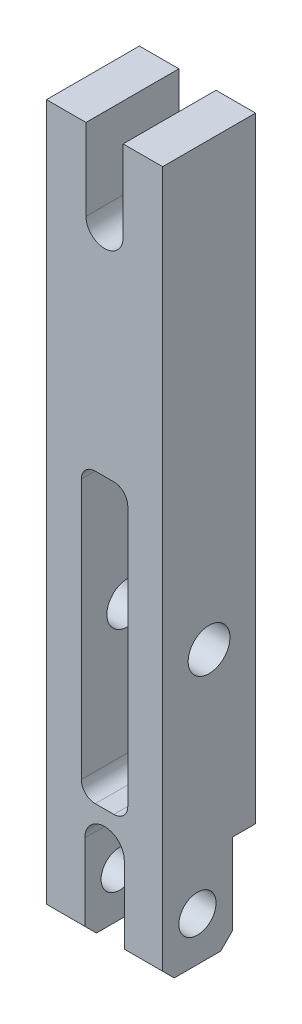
from build123d import *

# Parameters (mm, degrees)
VOLUME_DEPTH               = 40
ESQUISSE6_W                = 30
ESQUISSE6_H                = 60
EVIDEMMENT_DEPTH           = 201.499376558
ESQUISSE2_R                = 8
AL_SAGE_16_DEPTH           = 201.499376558
ESQUISSE5_R                = 9
AL_SAGE_18_PALONNIER_DEPTH = 201.499376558
CHANFREIN1_SIZE            = 5


with BuildPart() as part:
    # Esquisse1 → Volume (new body)
    with BuildSketch(Plane.XY):
        with BuildLine():
            Line((8, 190), (25, 190))
            Line((25, 190), (25, -115))
            Line((25, -115), (8.5, -115))
            Line((8.5, -115), (8.5, -77))
            ThreePointArc((8.5, -77), (0, -68.5), (-8.5, -77))
            Line((-8.5, -77), (-8.5, -115))
            Line((-8.5, -115), (-25, -115))
            Line((-25, -115), (-25, 190))
            Line((-25, 190), (-8, 190))
            Line((-8, 190), (-8, 155))
            ThreePointArc((-8, 155), (0, 147), (8, 155))
            Line((8, 155), (8, 190))
        make_face()
        with BuildLine():
            Line((-4, 62), (4, 62))
            ThreePointArc((4, 62), (8.242640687, 60.242640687), (10, 56))
            Line((10, 56), (10, -56))
            ThreePointArc((10, -56), (8.242640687, -60.242640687), (4, -62))
            Line((4, -62), (-4, -62))
            ThreePointArc((-4, -62), (-8.242640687, -60.242640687), (-10, -56))
            Line((-10, -56), (-10, 56))
            ThreePointArc((-10, 56), (-8.242640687, 60.242640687), (-4, 62))
        make_face(mode=Mode.SUBTRACT)
    extrude(amount=VOLUME_DEPTH)

    # Esquisse6 → Evidemment (cut, through all)
    with BuildSketch(Plane.ZY.offset(25)):
        with Locations((-5, -105)):
            Rectangle(ESQUISSE6_W, ESQUISSE6_H)
    extrude(amount=-EVIDEMMENT_DEPTH, mode=Mode.SUBTRACT)

    # Esquisse2 → Al_sage _16 (cut, through all)
    with BuildSketch(Plane.ZY.offset(25)):
        with Locations(Location((25, -96, 0), (0, 0, 270))):
            Circle(ESQUISSE2_R)
    extrude(amount=-AL_SAGE_16_DEPTH, mode=Mode.SUBTRACT)

    # Esquisse5 → Al_sage _18 palonnier (cut, through all)
    with BuildSketch(Plane.ZY.offset(25)):
        with Locations(Location((20, 0, 0), (0, 0, 270))):
            Circle(ESQUISSE5_R)
    extrude(amount=-AL_SAGE_18_PALONNIER_DEPTH, mode=Mode.SUBTRACT)

    # Chanfrein1
    chanfrein1_edges = [part.edges().sort_by_distance(p)[0] for p in [
        (16.75, -115, 40),
        (-16.75, -115, 10),
        (-16.75, -115, 40),
        (16.75, -115, 10),
    ]]
    chamfer(chanfrein1_edges, length=CHANFREIN1_SIZE)


solid = part.part
